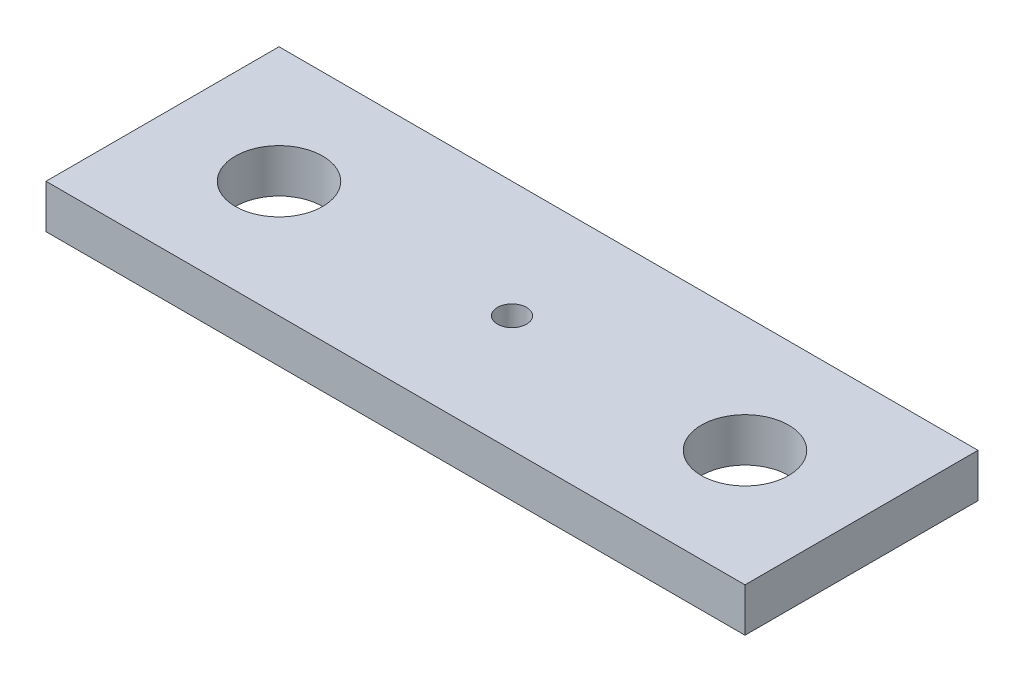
from build123d import *

# Parameters (mm, degrees)
SKETCH1_W          = 152.4
SKETCH1_H          = 50.8
EXTRUDE1_DEPTH     = 9.525
SKETCH2_R          = 9.525
CUT_EXTRUDE1_DEPTH = 81.884643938
SKETCH3_R          = 3.175
CUT_EXTRUDE2_DEPTH = 81.884643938


with BuildPart() as part:
    # Sketch1 → Extrude1 (new body)
    with BuildSketch(Plane(origin=(0, 0, 0), x_dir=(1, 0, 0), z_dir=(0, 1, 0))):
        Rectangle(SKETCH1_W, SKETCH1_H)
    extrude(amount=EXTRUDE1_DEPTH)

    # Sketch2 → Cut-Extrude1 (cut, through all)
    with BuildSketch(Plane(origin=(0, 9.525, 0), x_dir=(-1, 0, 0), z_dir=(0, 1, 0))):
        with Locations(Location((50.8, 0, 0), (0, 0, 90))):
            Circle(SKETCH2_R)
        with Locations(Location((-50.8, 0, 0), (0, 0, 90))):
            Circle(SKETCH2_R)
    extrude(amount=-CUT_EXTRUDE1_DEPTH, mode=Mode.SUBTRACT)

    # Sketch3 → Cut-Extrude2 (cut, through all)
    with BuildSketch(Plane(origin=(0, 9.525, 0), x_dir=(-1, 0, 0), z_dir=(0, 1, 0))):
        with Locations(Location((0, 0, 0), (0, 0, 90))):
            Circle(SKETCH3_R)
    extrude(amount=-CUT_EXTRUDE2_DEPTH, mode=Mode.SUBTRACT)


solid = part.part
